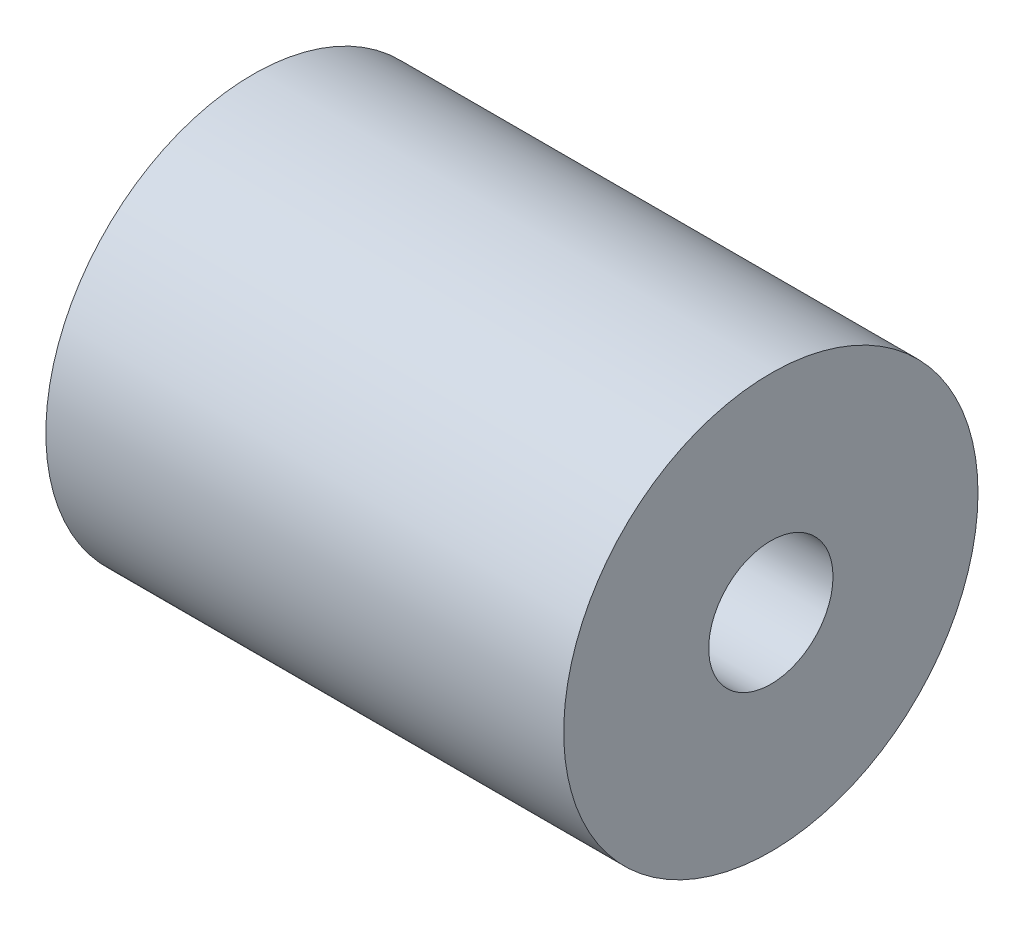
from build123d import *

# Parameters (mm, degrees)
SKETCH1_R           = 10
SKETCH1_R_2         = 3
BOSS_EXTRUDE1_DEPTH = 25


with BuildPart() as part:
    # Sketch1 → Boss-Extrude1 (new body)
    with BuildSketch(Plane(origin=(0, 0, 0), x_dir=(0, 0, -1), z_dir=(1, 0, 0))):
        Circle(SKETCH1_R)
        Circle(SKETCH1_R_2, mode=Mode.SUBTRACT)
    extrude(amount=BOSS_EXTRUDE1_DEPTH)


solid = part.part
